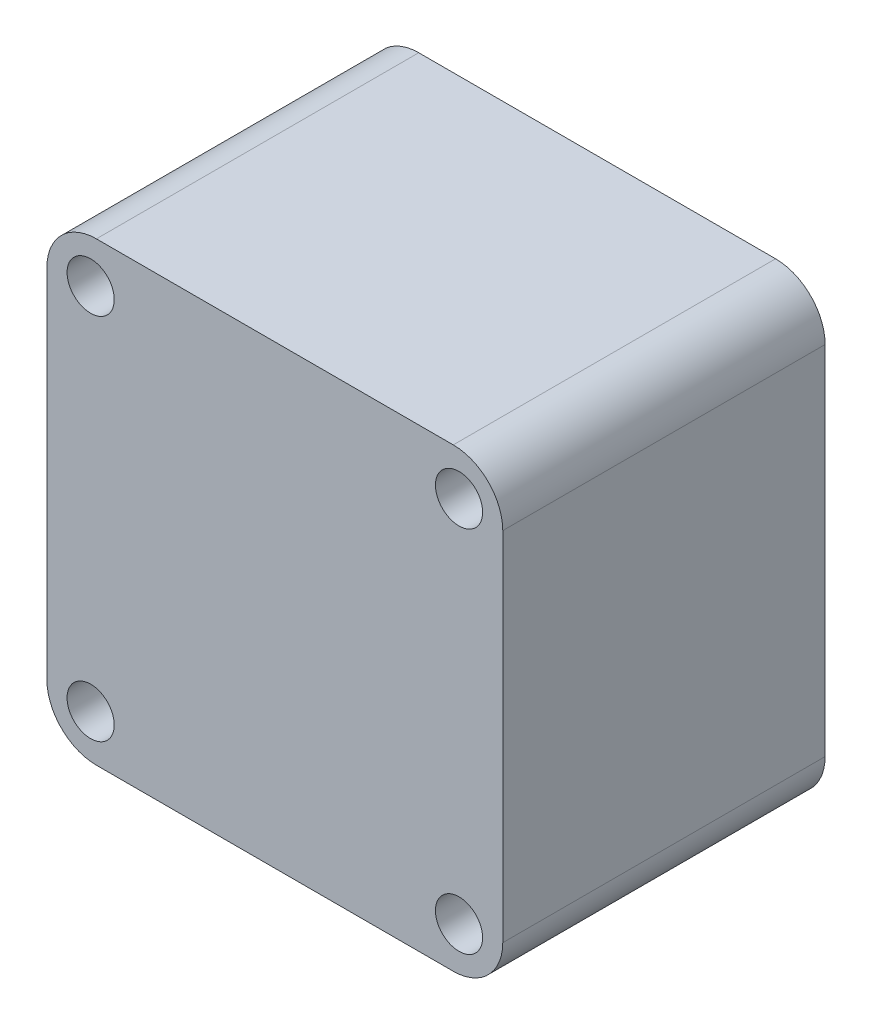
ISO-10303-21;
HEADER;
FILE_DESCRIPTION(('STEP AP214'),'2;1');
FILE_NAME('part.step','',(''),(''),'','','');
FILE_SCHEMA(('AUTOMOTIVE_DESIGN { 1 0 10303 214 1 1 1 1 }'));
ENDSEC;
DATA;
#1=APPLICATION_CONTEXT('core data for automotive mechanical design processes');
#2=APPLICATION_PROTOCOL_DEFINITION('international standard','automotive_design',2000,#1);
#3=PRODUCT_CONTEXT('',#1,'mechanical');
#4=PRODUCT('Part','Part','',(#3));
#5=PRODUCT_RELATED_PRODUCT_CATEGORY('part','',(#4));
#6=PRODUCT_DEFINITION_FORMATION('','',#4);
#7=PRODUCT_DEFINITION_CONTEXT('part definition',#1,'design');
#8=PRODUCT_DEFINITION('design','',#6,#7);
#9=PRODUCT_DEFINITION_SHAPE('','',#8);
#10=(LENGTH_UNIT() NAMED_UNIT(*) SI_UNIT(.MILLI.,.METRE.));
#11=(NAMED_UNIT(*) PLANE_ANGLE_UNIT() SI_UNIT($,.RADIAN.));
#12=(NAMED_UNIT(*) SI_UNIT($,.STERADIAN.) SOLID_ANGLE_UNIT());
#13=UNCERTAINTY_MEASURE_WITH_UNIT(LENGTH_MEASURE(1.E-05),#10,'distance_accuracy_value','');
#14=(GEOMETRIC_REPRESENTATION_CONTEXT(3) GLOBAL_UNCERTAINTY_ASSIGNED_CONTEXT((#13)) GLOBAL_UNIT_ASSIGNED_CONTEXT((#10,
#11,#12)) REPRESENTATION_CONTEXT('',''));
#15=CARTESIAN_POINT('',(0.,0.,0.));
#16=DIRECTION('',(0.,0.,1.));
#17=DIRECTION('',(1.,0.,0.));
#18=AXIS2_PLACEMENT_3D('',#15,#16,#17);
#19=CARTESIAN_POINT('',(653.170689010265,848.087694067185,-84.0028570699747));
#20=DIRECTION('',(0.,0.,1.));
#21=DIRECTION('',(1.,0.,0.));
#22=AXIS2_PLACEMENT_3D('',#19,#20,#21);
#23=CYLINDRICAL_SURFACE('',#22,2.05);
#24=CARTESIAN_POINT('',(653.170689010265,848.087694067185,0.));
#25=DIRECTION('',(0.,0.,1.));
#26=DIRECTION('',(1.,0.,0.));
#27=AXIS2_PLACEMENT_3D('',#24,#25,#26);
#28=CIRCLE('',#27,2.05);
#29=CARTESIAN_POINT('',(655.220689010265,848.087694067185,0.));
#30=VERTEX_POINT('',#29);
#31=EDGE_CURVE('E185',#30,#30,#28,.T.);
#32=ORIENTED_EDGE('',*,*,#31,.T.);
#33=EDGE_LOOP('',(#32));
#34=FACE_BOUND('',#33,.T.);
#35=CARTESIAN_POINT('',(653.170689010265,848.087694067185,-28.));
#36=DIRECTION('',(0.,0.,-1.));
#37=DIRECTION('',(-1.,0.,0.));
#38=AXIS2_PLACEMENT_3D('',#35,#36,#37);
#39=CIRCLE('',#38,2.05);
#40=CARTESIAN_POINT('',(651.120689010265,848.087694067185,-28.));
#41=VERTEX_POINT('',#40);
#42=EDGE_CURVE('E11',#41,#41,#39,.F.);
#43=ORIENTED_EDGE('',*,*,#42,.F.);
#44=EDGE_LOOP('',(#43));
#45=FACE_BOUND('',#44,.T.);
#46=ADVANCED_FACE('F45',(#34,#45),#23,.F.);
#47=CARTESIAN_POINT('',(653.170689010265,880.087694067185,-84.0028570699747));
#48=DIRECTION('',(0.,0.,1.));
#49=DIRECTION('',(1.,0.,0.));
#50=AXIS2_PLACEMENT_3D('',#47,#48,#49);
#51=CYLINDRICAL_SURFACE('',#50,2.05000000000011);
#52=CARTESIAN_POINT('',(653.170689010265,880.087694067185,0.));
#53=DIRECTION('',(0.,0.,1.));
#54=DIRECTION('',(1.,0.,0.));
#55=AXIS2_PLACEMENT_3D('',#52,#53,#54);
#56=CIRCLE('',#55,2.05000000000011);
#57=CARTESIAN_POINT('',(655.220689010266,880.087694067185,0.));
#58=VERTEX_POINT('',#57);
#59=EDGE_CURVE('E189',#58,#58,#56,.T.);
#60=ORIENTED_EDGE('',*,*,#59,.T.);
#61=EDGE_LOOP('',(#60));
#62=FACE_BOUND('',#61,.T.);
#63=CARTESIAN_POINT('',(653.170689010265,880.087694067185,-28.));
#64=DIRECTION('',(0.,0.,-1.));
#65=DIRECTION('',(-1.,0.,0.));
#66=AXIS2_PLACEMENT_3D('',#63,#64,#65);
#67=CIRCLE('',#66,2.05000000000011);
#68=CARTESIAN_POINT('',(651.120689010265,880.087694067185,-28.));
#69=VERTEX_POINT('',#68);
#70=EDGE_CURVE('E55',#69,#69,#67,.F.);
#71=ORIENTED_EDGE('',*,*,#70,.F.);
#72=EDGE_LOOP('',(#71));
#73=FACE_BOUND('',#72,.T.);
#74=ADVANCED_FACE('F259',(#62,#73),#51,.F.);
#75=CARTESIAN_POINT('',(685.170689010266,880.087694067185,-84.0028570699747));
#76=DIRECTION('',(0.,0.,1.));
#77=DIRECTION('',(1.,0.,0.));
#78=AXIS2_PLACEMENT_3D('',#75,#76,#77);
#79=CYLINDRICAL_SURFACE('',#78,2.05);
#80=CARTESIAN_POINT('',(685.170689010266,880.087694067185,0.));
#81=DIRECTION('',(0.,0.,1.));
#82=DIRECTION('',(1.,0.,0.));
#83=AXIS2_PLACEMENT_3D('',#80,#81,#82);
#84=CIRCLE('',#83,2.05);
#85=CARTESIAN_POINT('',(687.220689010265,880.087694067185,0.));
#86=VERTEX_POINT('',#85);
#87=EDGE_CURVE('E192',#86,#86,#84,.T.);
#88=ORIENTED_EDGE('',*,*,#87,.T.);
#89=EDGE_LOOP('',(#88));
#90=FACE_BOUND('',#89,.T.);
#91=CARTESIAN_POINT('',(685.170689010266,880.087694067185,-28.));
#92=DIRECTION('',(0.,0.,-1.));
#93=DIRECTION('',(-1.,0.,0.));
#94=AXIS2_PLACEMENT_3D('',#91,#92,#93);
#95=CIRCLE('',#94,2.05);
#96=CARTESIAN_POINT('',(683.120689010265,880.087694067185,-28.));
#97=VERTEX_POINT('',#96);
#98=EDGE_CURVE('E202',#97,#97,#95,.F.);
#99=ORIENTED_EDGE('',*,*,#98,.F.);
#100=EDGE_LOOP('',(#99));
#101=FACE_BOUND('',#100,.T.);
#102=ADVANCED_FACE('F264',(#90,#101),#79,.F.);
#103=CARTESIAN_POINT('',(685.170689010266,848.087694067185,-84.0028570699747));
#104=DIRECTION('',(0.,0.,1.));
#105=DIRECTION('',(1.,0.,0.));
#106=AXIS2_PLACEMENT_3D('',#103,#104,#105);
#107=CYLINDRICAL_SURFACE('',#106,2.05);
#108=CARTESIAN_POINT('',(685.170689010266,848.087694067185,0.));
#109=DIRECTION('',(0.,0.,1.));
#110=DIRECTION('',(1.,0.,0.));
#111=AXIS2_PLACEMENT_3D('',#108,#109,#110);
#112=CIRCLE('',#111,2.05);
#113=CARTESIAN_POINT('',(687.220689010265,848.087694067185,0.));
#114=VERTEX_POINT('',#113);
#115=EDGE_CURVE('E126',#114,#114,#112,.T.);
#116=ORIENTED_EDGE('',*,*,#115,.T.);
#117=EDGE_LOOP('',(#116));
#118=FACE_BOUND('',#117,.T.);
#119=CARTESIAN_POINT('',(685.170689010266,848.087694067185,-28.));
#120=DIRECTION('',(0.,0.,-1.));
#121=DIRECTION('',(-1.,0.,0.));
#122=AXIS2_PLACEMENT_3D('',#119,#120,#121);
#123=CIRCLE('',#122,2.05);
#124=CARTESIAN_POINT('',(683.120689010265,848.087694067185,-28.));
#125=VERTEX_POINT('',#124);
#126=EDGE_CURVE('E120',#125,#125,#123,.F.);
#127=ORIENTED_EDGE('',*,*,#126,.F.);
#128=EDGE_LOOP('',(#127));
#129=FACE_BOUND('',#128,.T.);
#130=ADVANCED_FACE('F47',(#118,#129),#107,.F.);
#131=CARTESIAN_POINT('',(0.,0.,0.));
#132=DIRECTION('',(0.,0.,1.));
#133=DIRECTION('',(1.,0.,0.));
#134=AXIS2_PLACEMENT_3D('',#131,#132,#133);
#135=PLANE('',#134);
#136=ORIENTED_EDGE('',*,*,#115,.F.);
#137=EDGE_LOOP('',(#136));
#138=FACE_BOUND('',#137,.T.);
#139=ORIENTED_EDGE('',*,*,#87,.F.);
#140=EDGE_LOOP('',(#139));
#141=FACE_BOUND('',#140,.T.);
#142=ORIENTED_EDGE('',*,*,#59,.F.);
#143=EDGE_LOOP('',(#142));
#144=FACE_BOUND('',#143,.T.);
#145=ORIENTED_EDGE('',*,*,#31,.F.);
#146=EDGE_LOOP('',(#145));
#147=FACE_BOUND('',#146,.T.);
#148=DIRECTION('',(1.,0.,0.));
#149=VECTOR('',#148,1.);
#150=CARTESIAN_POINT('',(0.,844.287694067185,0.));
#151=LINE('',#150,#149);
#152=CARTESIAN_POINT('',(653.670689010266,844.287694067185,0.));
#153=VERTEX_POINT('',#152);
#154=CARTESIAN_POINT('',(684.670689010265,844.287694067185,0.));
#155=VERTEX_POINT('',#154);
#156=EDGE_CURVE('E183',#153,#155,#151,.T.);
#157=ORIENTED_EDGE('',*,*,#156,.T.);
#158=CARTESIAN_POINT('',(684.670689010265,848.587694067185,0.));
#159=DIRECTION('',(0.,0.,1.));
#160=DIRECTION('',(1.,0.,0.));
#161=AXIS2_PLACEMENT_3D('',#158,#159,#160);
#162=CIRCLE('',#161,4.30000000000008);
#163=CARTESIAN_POINT('',(688.970689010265,848.587694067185,0.));
#164=VERTEX_POINT('',#163);
#165=EDGE_CURVE('E131',#155,#164,#162,.T.);
#166=ORIENTED_EDGE('',*,*,#165,.T.);
#167=DIRECTION('',(0.,1.,0.));
#168=VECTOR('',#167,1.);
#169=CARTESIAN_POINT('',(688.970689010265,0.,0.));
#170=LINE('',#169,#168);
#171=CARTESIAN_POINT('',(688.970689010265,879.587694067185,0.));
#172=VERTEX_POINT('',#171);
#173=EDGE_CURVE('E177',#164,#172,#170,.T.);
#174=ORIENTED_EDGE('',*,*,#173,.T.);
#175=CARTESIAN_POINT('',(684.670689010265,879.587694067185,0.));
#176=DIRECTION('',(0.,0.,1.));
#177=DIRECTION('',(1.,0.,0.));
#178=AXIS2_PLACEMENT_3D('',#175,#176,#177);
#179=CIRCLE('',#178,4.30000000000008);
#180=CARTESIAN_POINT('',(684.670689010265,883.887694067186,0.));
#181=VERTEX_POINT('',#180);
#182=EDGE_CURVE('E173',#172,#181,#179,.T.);
#183=ORIENTED_EDGE('',*,*,#182,.T.);
#184=DIRECTION('',(-1.,0.,0.));
#185=VECTOR('',#184,1.);
#186=CARTESIAN_POINT('',(0.,883.887694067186,0.));
#187=LINE('',#186,#185);
#188=CARTESIAN_POINT('',(653.670689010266,883.887694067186,0.));
#189=VERTEX_POINT('',#188);
#190=EDGE_CURVE('E169',#181,#189,#187,.T.);
#191=ORIENTED_EDGE('',*,*,#190,.T.);
#192=CARTESIAN_POINT('',(653.670689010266,879.587694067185,0.));
#193=DIRECTION('',(0.,0.,1.));
#194=DIRECTION('',(1.,0.,0.));
#195=AXIS2_PLACEMENT_3D('',#192,#193,#194);
#196=CIRCLE('',#195,4.30000000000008);
#197=CARTESIAN_POINT('',(649.370689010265,879.587694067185,0.));
#198=VERTEX_POINT('',#197);
#199=EDGE_CURVE('E165',#189,#198,#196,.T.);
#200=ORIENTED_EDGE('',*,*,#199,.T.);
#201=DIRECTION('',(0.,-1.,0.));
#202=VECTOR('',#201,1.);
#203=CARTESIAN_POINT('',(649.370689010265,0.,0.));
#204=LINE('',#203,#202);
#205=CARTESIAN_POINT('',(649.370689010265,848.587694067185,0.));
#206=VERTEX_POINT('',#205);
#207=EDGE_CURVE('E143',#198,#206,#204,.T.);
#208=ORIENTED_EDGE('',*,*,#207,.T.);
#209=CARTESIAN_POINT('',(653.670689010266,848.587694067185,0.));
#210=DIRECTION('',(0.,0.,1.));
#211=DIRECTION('',(1.,0.,0.));
#212=AXIS2_PLACEMENT_3D('',#209,#210,#211);
#213=CIRCLE('',#212,4.30000000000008);
#214=EDGE_CURVE('E135',#206,#153,#213,.T.);
#215=ORIENTED_EDGE('',*,*,#214,.T.);
#216=EDGE_LOOP('',(#157,#166,#174,#183,#191,#200,#208,#215));
#217=FACE_BOUND('',#216,.T.);
#218=ADVANCED_FACE('F234',(#138,#141,#144,#147,#217),#135,.T.);
#219=CARTESIAN_POINT('',(684.670689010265,848.587694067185,-84.0028570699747));
#220=DIRECTION('',(0.,0.,1.));
#221=DIRECTION('',(1.,0.,0.));
#222=AXIS2_PLACEMENT_3D('',#219,#220,#221);
#223=CYLINDRICAL_SURFACE('',#222,4.30000000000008);
#224=DIRECTION('',(0.,0.,1.));
#225=VECTOR('',#224,1.);
#226=CARTESIAN_POINT('',(684.670689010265,844.287694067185,-84.0028570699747));
#227=LINE('',#226,#225);
#228=CARTESIAN_POINT('',(684.670689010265,844.287694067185,-28.));
#229=VERTEX_POINT('',#228);
#230=EDGE_CURVE('E123',#229,#155,#227,.T.);
#231=ORIENTED_EDGE('',*,*,#230,.F.);
#232=CARTESIAN_POINT('',(684.670689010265,848.587694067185,-28.));
#233=DIRECTION('',(0.,0.,-1.));
#234=DIRECTION('',(-1.,0.,0.));
#235=AXIS2_PLACEMENT_3D('',#232,#233,#234);
#236=CIRCLE('',#235,4.30000000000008);
#237=CARTESIAN_POINT('',(688.970689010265,848.587694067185,-28.));
#238=VERTEX_POINT('',#237);
#239=EDGE_CURVE('E49',#229,#238,#236,.F.);
#240=ORIENTED_EDGE('',*,*,#239,.T.);
#241=DIRECTION('',(0.,0.,1.));
#242=VECTOR('',#241,1.);
#243=CARTESIAN_POINT('',(688.970689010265,848.587694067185,-84.0028570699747));
#244=LINE('',#243,#242);
#245=EDGE_CURVE('E134',#238,#164,#244,.T.);
#246=ORIENTED_EDGE('',*,*,#245,.T.);
#247=ORIENTED_EDGE('',*,*,#165,.F.);
#248=EDGE_LOOP('',(#231,#240,#246,#247));
#249=FACE_BOUND('',#248,.T.);
#250=ADVANCED_FACE('F129',(#249),#223,.T.);
#251=CARTESIAN_POINT('',(688.970689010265,0.,-84.0028570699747));
#252=DIRECTION('',(1.,0.,0.));
#253=DIRECTION('',(0.,0.,-1.));
#254=AXIS2_PLACEMENT_3D('',#251,#252,#253);
#255=PLANE('',#254);
#256=ORIENTED_EDGE('',*,*,#245,.F.);
#257=DIRECTION('',(0.,1.,0.));
#258=VECTOR('',#257,1.);
#259=CARTESIAN_POINT('',(688.970689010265,0.,-28.));
#260=LINE('',#259,#258);
#261=CARTESIAN_POINT('',(688.970689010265,879.587694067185,-28.));
#262=VERTEX_POINT('',#261);
#263=EDGE_CURVE('E63',#238,#262,#260,.T.);
#264=ORIENTED_EDGE('',*,*,#263,.T.);
#265=DIRECTION('',(0.,0.,1.));
#266=VECTOR('',#265,1.);
#267=CARTESIAN_POINT('',(688.970689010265,879.587694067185,-84.0028570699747));
#268=LINE('',#267,#266);
#269=EDGE_CURVE('E139',#262,#172,#268,.T.);
#270=ORIENTED_EDGE('',*,*,#269,.T.);
#271=ORIENTED_EDGE('',*,*,#173,.F.);
#272=EDGE_LOOP('',(#256,#264,#270,#271));
#273=FACE_BOUND('',#272,.T.);
#274=ADVANCED_FACE('F229',(#273),#255,.T.);
#275=CARTESIAN_POINT('',(684.670689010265,879.587694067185,-84.0028570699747));
#276=DIRECTION('',(0.,0.,1.));
#277=DIRECTION('',(1.,0.,0.));
#278=AXIS2_PLACEMENT_3D('',#275,#276,#277);
#279=CYLINDRICAL_SURFACE('',#278,4.30000000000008);
#280=ORIENTED_EDGE('',*,*,#269,.F.);
#281=CARTESIAN_POINT('',(684.670689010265,879.587694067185,-28.));
#282=DIRECTION('',(0.,0.,-1.));
#283=DIRECTION('',(-1.,0.,0.));
#284=AXIS2_PLACEMENT_3D('',#281,#282,#283);
#285=CIRCLE('',#284,4.30000000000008);
#286=CARTESIAN_POINT('',(684.670689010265,883.887694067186,-28.));
#287=VERTEX_POINT('',#286);
#288=EDGE_CURVE('E223',#262,#287,#285,.F.);
#289=ORIENTED_EDGE('',*,*,#288,.T.);
#290=DIRECTION('',(0.,0.,1.));
#291=VECTOR('',#290,1.);
#292=CARTESIAN_POINT('',(684.670689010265,883.887694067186,-84.0028570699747));
#293=LINE('',#292,#291);
#294=EDGE_CURVE('E148',#287,#181,#293,.T.);
#295=ORIENTED_EDGE('',*,*,#294,.T.);
#296=ORIENTED_EDGE('',*,*,#182,.F.);
#297=EDGE_LOOP('',(#280,#289,#295,#296));
#298=FACE_BOUND('',#297,.T.);
#299=ADVANCED_FACE('F250',(#298),#279,.T.);
#300=CARTESIAN_POINT('',(0.,883.887694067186,-84.0028570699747));
#301=DIRECTION('',(0.,1.,0.));
#302=DIRECTION('',(0.,0.,1.));
#303=AXIS2_PLACEMENT_3D('',#300,#301,#302);
#304=PLANE('',#303);
#305=ORIENTED_EDGE('',*,*,#294,.F.);
#306=DIRECTION('',(-1.,0.,0.));
#307=VECTOR('',#306,1.);
#308=CARTESIAN_POINT('',(0.,883.887694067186,-28.));
#309=LINE('',#308,#307);
#310=CARTESIAN_POINT('',(653.670689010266,883.887694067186,-28.));
#311=VERTEX_POINT('',#310);
#312=EDGE_CURVE('E219',#287,#311,#309,.T.);
#313=ORIENTED_EDGE('',*,*,#312,.T.);
#314=DIRECTION('',(0.,0.,1.));
#315=VECTOR('',#314,1.);
#316=CARTESIAN_POINT('',(653.670689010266,883.887694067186,-84.0028570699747));
#317=LINE('',#316,#315);
#318=EDGE_CURVE('E151',#311,#189,#317,.T.);
#319=ORIENTED_EDGE('',*,*,#318,.T.);
#320=ORIENTED_EDGE('',*,*,#190,.F.);
#321=EDGE_LOOP('',(#305,#313,#319,#320));
#322=FACE_BOUND('',#321,.T.);
#323=ADVANCED_FACE('F248',(#322),#304,.T.);
#324=CARTESIAN_POINT('',(653.670689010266,879.587694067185,-84.0028570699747));
#325=DIRECTION('',(0.,0.,1.));
#326=DIRECTION('',(1.,0.,0.));
#327=AXIS2_PLACEMENT_3D('',#324,#325,#326);
#328=CYLINDRICAL_SURFACE('',#327,4.30000000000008);
#329=ORIENTED_EDGE('',*,*,#318,.F.);
#330=CARTESIAN_POINT('',(653.670689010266,879.587694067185,-28.));
#331=DIRECTION('',(0.,0.,-1.));
#332=DIRECTION('',(-1.,0.,0.));
#333=AXIS2_PLACEMENT_3D('',#330,#331,#332);
#334=CIRCLE('',#333,4.30000000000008);
#335=CARTESIAN_POINT('',(649.370689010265,879.587694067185,-28.));
#336=VERTEX_POINT('',#335);
#337=EDGE_CURVE('E215',#311,#336,#334,.F.);
#338=ORIENTED_EDGE('',*,*,#337,.T.);
#339=DIRECTION('',(0.,0.,1.));
#340=VECTOR('',#339,1.);
#341=CARTESIAN_POINT('',(649.370689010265,879.587694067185,-84.0028570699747));
#342=LINE('',#341,#340);
#343=EDGE_CURVE('E154',#336,#198,#342,.T.);
#344=ORIENTED_EDGE('',*,*,#343,.T.);
#345=ORIENTED_EDGE('',*,*,#199,.F.);
#346=EDGE_LOOP('',(#329,#338,#344,#345));
#347=FACE_BOUND('',#346,.T.);
#348=ADVANCED_FACE('F245',(#347),#328,.T.);
#349=CARTESIAN_POINT('',(649.370689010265,0.,-84.0028570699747));
#350=DIRECTION('',(-1.,0.,0.));
#351=DIRECTION('',(0.,0.,1.));
#352=AXIS2_PLACEMENT_3D('',#349,#350,#351);
#353=PLANE('',#352);
#354=ORIENTED_EDGE('',*,*,#343,.F.);
#355=DIRECTION('',(0.,-1.,0.));
#356=VECTOR('',#355,1.);
#357=CARTESIAN_POINT('',(649.370689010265,0.,-28.));
#358=LINE('',#357,#356);
#359=CARTESIAN_POINT('',(649.370689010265,848.587694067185,-28.));
#360=VERTEX_POINT('',#359);
#361=EDGE_CURVE('E211',#336,#360,#358,.T.);
#362=ORIENTED_EDGE('',*,*,#361,.T.);
#363=DIRECTION('',(0.,0.,1.));
#364=VECTOR('',#363,1.);
#365=CARTESIAN_POINT('',(649.370689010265,848.587694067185,-84.0028570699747));
#366=LINE('',#365,#364);
#367=EDGE_CURVE('E157',#360,#206,#366,.T.);
#368=ORIENTED_EDGE('',*,*,#367,.T.);
#369=ORIENTED_EDGE('',*,*,#207,.F.);
#370=EDGE_LOOP('',(#354,#362,#368,#369));
#371=FACE_BOUND('',#370,.T.);
#372=ADVANCED_FACE('F240',(#371),#353,.T.);
#373=CARTESIAN_POINT('',(653.670689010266,848.587694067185,-84.0028570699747));
#374=DIRECTION('',(0.,0.,1.));
#375=DIRECTION('',(1.,0.,0.));
#376=AXIS2_PLACEMENT_3D('',#373,#374,#375);
#377=CYLINDRICAL_SURFACE('',#376,4.30000000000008);
#378=ORIENTED_EDGE('',*,*,#367,.F.);
#379=CARTESIAN_POINT('',(653.670689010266,848.587694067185,-28.));
#380=DIRECTION('',(0.,0.,-1.));
#381=DIRECTION('',(-1.,0.,0.));
#382=AXIS2_PLACEMENT_3D('',#379,#380,#381);
#383=CIRCLE('',#382,4.30000000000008);
#384=CARTESIAN_POINT('',(653.670689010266,844.287694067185,-28.));
#385=VERTEX_POINT('',#384);
#386=EDGE_CURVE('E127',#360,#385,#383,.F.);
#387=ORIENTED_EDGE('',*,*,#386,.T.);
#388=DIRECTION('',(0.,0.,1.));
#389=VECTOR('',#388,1.);
#390=CARTESIAN_POINT('',(653.670689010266,844.287694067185,-84.0028570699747));
#391=LINE('',#390,#389);
#392=EDGE_CURVE('E71',#385,#153,#391,.T.);
#393=ORIENTED_EDGE('',*,*,#392,.T.);
#394=ORIENTED_EDGE('',*,*,#214,.F.);
#395=EDGE_LOOP('',(#378,#387,#393,#394));
#396=FACE_BOUND('',#395,.T.);
#397=ADVANCED_FACE('F237',(#396),#377,.T.);
#398=CARTESIAN_POINT('',(0.,844.287694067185,-84.0028570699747));
#399=DIRECTION('',(0.,-1.,0.));
#400=DIRECTION('',(0.,0.,-1.));
#401=AXIS2_PLACEMENT_3D('',#398,#399,#400);
#402=PLANE('',#401);
#403=ORIENTED_EDGE('',*,*,#392,.F.);
#404=DIRECTION('',(1.,0.,0.));
#405=VECTOR('',#404,1.);
#406=CARTESIAN_POINT('',(0.,844.287694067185,-28.));
#407=LINE('',#406,#405);
#408=EDGE_CURVE('E116',#385,#229,#407,.T.);
#409=ORIENTED_EDGE('',*,*,#408,.T.);
#410=ORIENTED_EDGE('',*,*,#230,.T.);
#411=ORIENTED_EDGE('',*,*,#156,.F.);
#412=EDGE_LOOP('',(#403,#409,#410,#411));
#413=FACE_BOUND('',#412,.T.);
#414=ADVANCED_FACE('F122',(#413),#402,.T.);
#415=CARTESIAN_POINT('',(653.670689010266,848.587694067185,-28.));
#416=DIRECTION('',(0.,0.,-1.));
#417=DIRECTION('',(0.,-1.,0.));
#418=AXIS2_PLACEMENT_3D('',#415,#416,#417);
#419=PLANE('',#418);
#420=ORIENTED_EDGE('',*,*,#70,.T.);
#421=EDGE_LOOP('',(#420));
#422=FACE_BOUND('',#421,.T.);
#423=ORIENTED_EDGE('',*,*,#126,.T.);
#424=EDGE_LOOP('',(#423));
#425=FACE_BOUND('',#424,.T.);
#426=ORIENTED_EDGE('',*,*,#408,.F.);
#427=ORIENTED_EDGE('',*,*,#386,.F.);
#428=ORIENTED_EDGE('',*,*,#361,.F.);
#429=ORIENTED_EDGE('',*,*,#337,.F.);
#430=ORIENTED_EDGE('',*,*,#312,.F.);
#431=ORIENTED_EDGE('',*,*,#288,.F.);
#432=ORIENTED_EDGE('',*,*,#263,.F.);
#433=ORIENTED_EDGE('',*,*,#239,.F.);
#434=EDGE_LOOP('',(#426,#427,#428,#429,#430,#431,#432,#433));
#435=FACE_BOUND('',#434,.T.);
#436=ORIENTED_EDGE('',*,*,#98,.T.);
#437=EDGE_LOOP('',(#436));
#438=FACE_BOUND('',#437,.T.);
#439=ORIENTED_EDGE('',*,*,#42,.T.);
#440=EDGE_LOOP('',(#439));
#441=FACE_BOUND('',#440,.T.);
#442=ADVANCED_FACE('F114',(#422,#425,#435,#438,#441),#419,.T.);
#443=CLOSED_SHELL('',(#46,#74,#102,#130,#218,#250,#274,#299,#323,#348,#372,#397,#414,#442));
#444=MANIFOLD_SOLID_BREP('B2',#443);
#445=ADVANCED_BREP_SHAPE_REPRESENTATION('',(#18,#444),#14);
#446=SHAPE_DEFINITION_REPRESENTATION(#9,#445);
ENDSEC;
END-ISO-10303-21;
